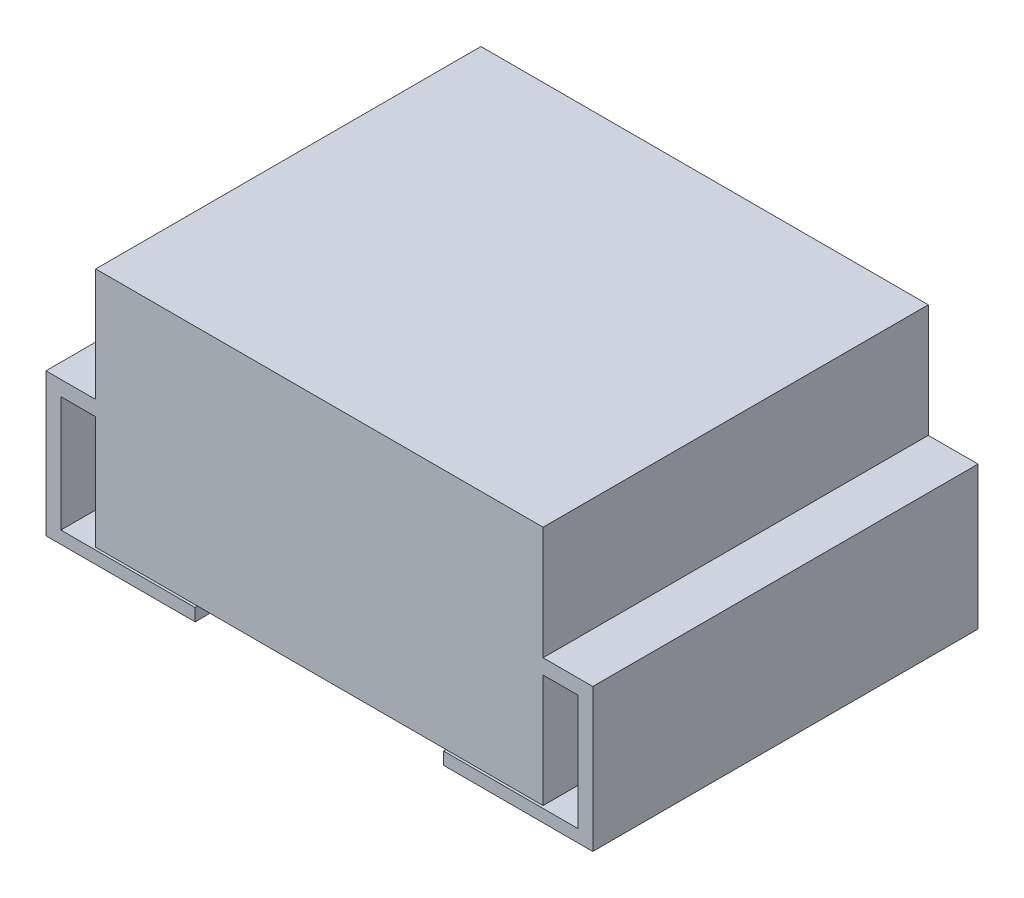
from build123d import *

# Parameters (mm, degrees)
SKETCH1_W           = 4.572
SKETCH1_H           = 3.937
BOSS_EXTRUDE1_DEPTH = 2.4638
SKETCH2_W           = 3.937
SKETCH2_H           = 0.1524
BOSS_EXTRUDE2_DEPTH = 0.3556
SKETCH3_W           = 3.937
SKETCH3_H           = 1.4605
BOSS_EXTRUDE3_DEPTH = 0.1524
SKETCH4_W           = 1.3716
SKETCH4_H           = 0.127
BOSS_EXTRUDE4_DEPTH = 3.937
SKETCH5_W           = 3.937
SKETCH5_H           = 0.1524
BOSS_EXTRUDE5_DEPTH = 0.3556
SKETCH7_W           = 3.937
SKETCH7_H           = 1.4605
BOSS_EXTRUDE6_DEPTH = 0.1524
SKETCH10_W          = 1.3716
SKETCH10_H          = 0.127
BOSS_EXTRUDE7_DEPTH = 3.937


with BuildPart() as part:
    # Sketch1 → Boss-Extrude1 (new body)
    with BuildSketch(Plane(origin=(0, 0, 0), x_dir=(1, 0, 0), z_dir=(0, 1, 0))):
        Rectangle(SKETCH1_W, SKETCH1_H)
    extrude(amount=BOSS_EXTRUDE1_DEPTH)

    # Sketch2 → Boss-Extrude2 (add)
    with BuildSketch(Plane.ZY.offset(2.286)):
        with Locations((0, 1.2319)):
            Rectangle(SKETCH2_W, SKETCH2_H)
    extrude(amount=BOSS_EXTRUDE2_DEPTH)

    # Sketch3 → Boss-Extrude3 (add)
    with BuildSketch(Plane.ZY.offset(2.6416)):
        with Locations((0, 0.57785)):
            Rectangle(SKETCH3_W, SKETCH3_H)
    extrude(amount=BOSS_EXTRUDE3_DEPTH)

    # Sketch4 → Boss-Extrude4 (add)
    with BuildSketch(Plane.XY.offset(1.9685)):
        with Locations((-1.9558, -0.0889)):
            Rectangle(SKETCH4_W, SKETCH4_H)
    extrude(amount=-BOSS_EXTRUDE4_DEPTH)

    # Sketch5 → Boss-Extrude5 (add)
    with BuildSketch(Plane(origin=(2.286, 0, 0), x_dir=(0, 0, -1), z_dir=(1, 0, 0))):
        with Locations((0, 1.2319)):
            Rectangle(SKETCH5_W, SKETCH5_H)
    extrude(amount=BOSS_EXTRUDE5_DEPTH)

    # Sketch7 → Boss-Extrude6 (add)
    with BuildSketch(Plane(origin=(2.6416, 0, 0), x_dir=(0, 0, -1), z_dir=(1, 0, 0))):
        with Locations((0, 0.57785)):
            Rectangle(SKETCH7_W, SKETCH7_H)
    extrude(amount=BOSS_EXTRUDE6_DEPTH)

    # Sketch10 → Boss-Extrude7 (add)
    with BuildSketch(Plane.XY.offset(1.9685)):
        with Locations((1.9558, -0.0889)):
            Rectangle(SKETCH10_W, SKETCH10_H)
    extrude(amount=-BOSS_EXTRUDE7_DEPTH)


solid = part.part
